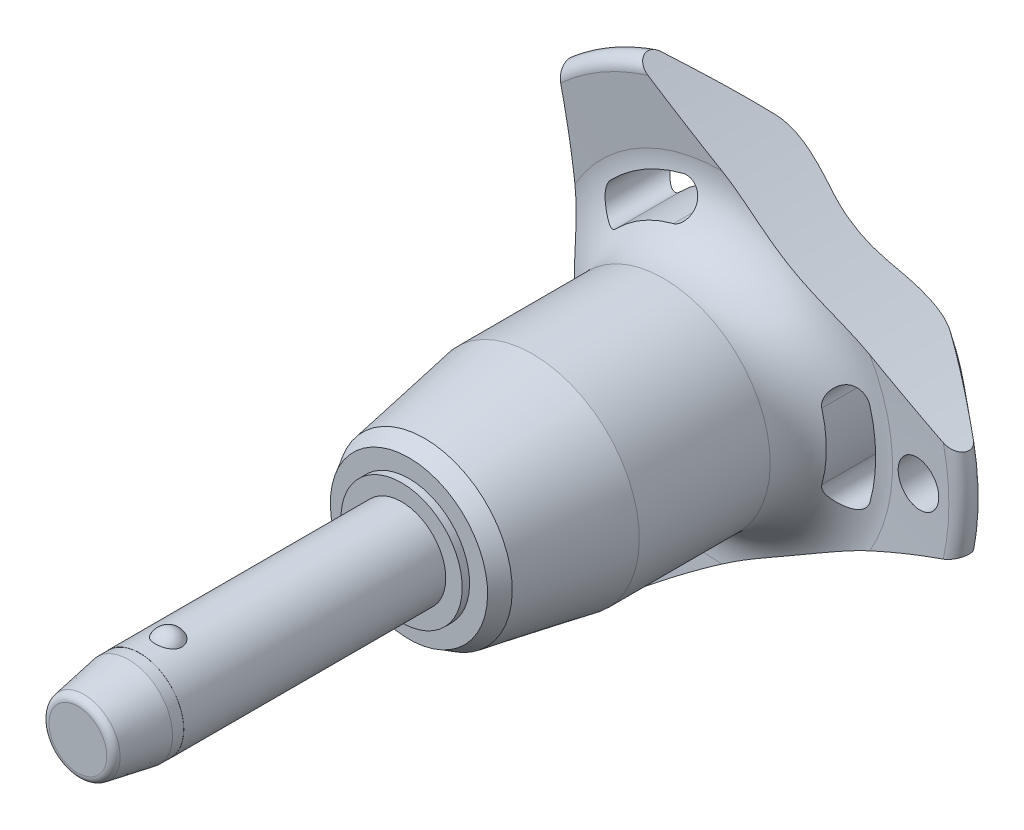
from build123d import *

# Parameters (mm, degrees)
SKETCH1_R           = 3
BOSS_EXTRUDE1_DEPTH = 15
SKETCH2_R           = 2.5
BOSS_EXTRUDE2_DEPTH = 26.7
BOSS_EXTRUDE3_START = 7
SKETCH1_2_R         = 3
BOSS_EXTRUDE3_DEPTH = 7
CHAMFER1_SIZE       = 3.5
CHAMFER1_SIZE2      = 0.617144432
FILLET1_R           = 0.5
SKETCH6_R           = 79.96
CUT_EXTRUDE1_DEPTH  = 48.854696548
CIRPATTERN1_COUNT   = 3
SKETCH7_R           = 1.5
CUT_EXTRUDE2_DEPTH  = 48.535566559
SKETCH8_R           = 3
SKETCH8_R_2         = 2.99
CUT_EXTRUDE3_DEPTH  = 4.2


with BuildPart() as part:
    # Sketch1 → Boss-Extrude1 (new body)
    with BuildSketch(Plane.XY):
        Circle(SKETCH1_R)
    extrude(amount=-BOSS_EXTRUDE1_DEPTH)

    # Sketch2 → Boss-Extrude2 (add)
    with BuildSketch(Plane(origin=(0, 0, -15), x_dir=(-1, 0, 0), z_dir=(0, 0, -1))):
        Circle(SKETCH2_R)
    extrude(amount=BOSS_EXTRUDE2_DEPTH)

    # Sketch3 → Revolve1 (revolve)
    with BuildSketch(Plane(origin=(0, 0, 0), x_dir=(0, 0, -1), z_dir=(1, 0, 0))):
        with BuildLine():
            Line((-0.866025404, 3.5), (-0.866025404, 1.5))
            ThreePointArc((-0.866025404, 1.5), (0.133974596, 2.5), (-0.866025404, 3.5))
        make_face()
        with BuildLine():
            Line((-0.866025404, -1.5), (-0.866025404, -3.5))
            ThreePointArc((-0.866025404, -3.5), (0.133974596, -2.5), (-0.866025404, -1.5))
        make_face()
    revolve(axis=Axis((0, -1.5, 0.866025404), (0, 1, 0)))

    # Sketch1_2 → Boss-Extrude3 (add)
    with BuildSketch(Plane.XY.offset(BOSS_EXTRUDE3_START)):
        Circle(SKETCH1_2_R)
    extrude(amount=-BOSS_EXTRUDE3_DEPTH)

    # Chamfer1
    chamfer1_edges = [part.edges().sort_by_distance(p)[0] for p in [
        (-3, 0, 7),
    ]]
    chamfer1_side = [part.faces().sort_by_distance(p)[0] for p in [
        (-3, 0, -4),
    ]]
    chamfer(chamfer1_edges, length=CHAMFER1_SIZE, length2=CHAMFER1_SIZE2, reference=chamfer1_side[0])

    # Fillet1
    fillet1_edges = [part.edges().sort_by_distance(p)[0] for p in [
        (-2.382855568, 0, 7),
        (2.5, 0, -41.7),
    ]]
    fillet(fillet1_edges, radius=FILLET1_R)

    # Sketch4 → Revolve2 (revolve)
    with BuildSketch(Plane(origin=(0, 0, 0), x_dir=(0, 0, -1), z_dir=(1, 0, 0))):
        Polygon((15, 0), (15, 4.118359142), (15.5, 4.118359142), (15.5, 5.343400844), (16.560917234, 5.955921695), (23.9, 7.25), (32.8, 7.25), (32.8, 0), align=None)
    revolve(axis=Axis((0, 0, -32.8), (0, 0, 1)))

    # Sketch5 → Revolve3 (revolve)
    with BuildSketch(Plane(origin=(0, 0, 0), x_dir=(0, 0, -1), z_dir=(1, 0, 0)), mode=Mode.PRIVATE) as revolve3_sk:
        with BuildLine():
            Line((36.78715932, 11.570250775), (36.452568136, 15.735949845))
            ThreePointArc((36.452568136, 15.735949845), (36.946485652, 16.540188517), (37.862835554, 16.314230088))
            Line((37.862835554, 16.314230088), (41.326414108, 12.186497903))
            ThreePointArc((41.326414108, 12.186497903), (41.7, 11.109282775), (41.261488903, 10.056825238))
            ThreePointArc((41.261488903, 10.056825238), (38.289873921, 5.413681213), (37.25, 0))
            Line((37.25, 0), (32.8, 0))
            Line((32.8, 0), (32.8, 7.25))
            ThreePointArc((32.8, 7.25), (35.739473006, 8.537160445), (36.78715932, 11.570250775))
        make_face()
    revolve(revolve3_sk.sketch.rotate(Axis((0, 0, -37.25), (0, 0, 1)), 90), axis=Axis((0, 0, -37.25), (0, 0, 1)))

    # Sketch6 → Cut-Extrude1 (cut, through all)
    with BuildSketch(Plane.XY):
        with Locations((-89.76, 0)):
            Circle(SKETCH6_R)
        with BuildLine():
            ThreePointArc((10.099921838, -2.834717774), (10.490188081, 0), (10.099921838, 2.834717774))
            ThreePointArc((10.099921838, 2.834717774), (8.768180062, 3.582738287), (8.020159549, 2.250996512))
            ThreePointArc((8.020159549, 2.250996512), (8.330062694, 0), (8.020159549, -2.250996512))
            ThreePointArc((8.020159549, -2.250996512), (8.768180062, -3.582738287), (10.099921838, -2.834717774))
        make_face()
    cut_extrude1 = extrude(amount=-CUT_EXTRUDE1_DEPTH, mode=Mode.SUBTRACT)

    # CirPattern1: Cut-Extrude1 ×3 about axis
    cirpattern1_axis = Axis((0, 0, 0), (0, 0, 1))
    for i in range(1, CIRPATTERN1_COUNT):
        add(cut_extrude1.rotate(cirpattern1_axis, i * 360 / CIRPATTERN1_COUNT), mode=Mode.SUBTRACT)

    # Sketch7 → Cut-Extrude2 (cut, through all)
    with BuildSketch(Plane.XY):
        with Locations(Location((13.490188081, 0, 0), (0, 0, 225.221865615))):
            Circle(SKETCH7_R)
    extrude(amount=-CUT_EXTRUDE2_DEPTH, mode=Mode.SUBTRACT)

    # Sketch8 → Cut-Extrude3 (cut)
    with BuildSketch(Plane.XY.offset(7)):
        Circle(SKETCH8_R)
        Circle(SKETCH8_R_2, mode=Mode.SUBTRACT)
    extrude(amount=-CUT_EXTRUDE3_DEPTH, mode=Mode.SUBTRACT)


solid = part.part
